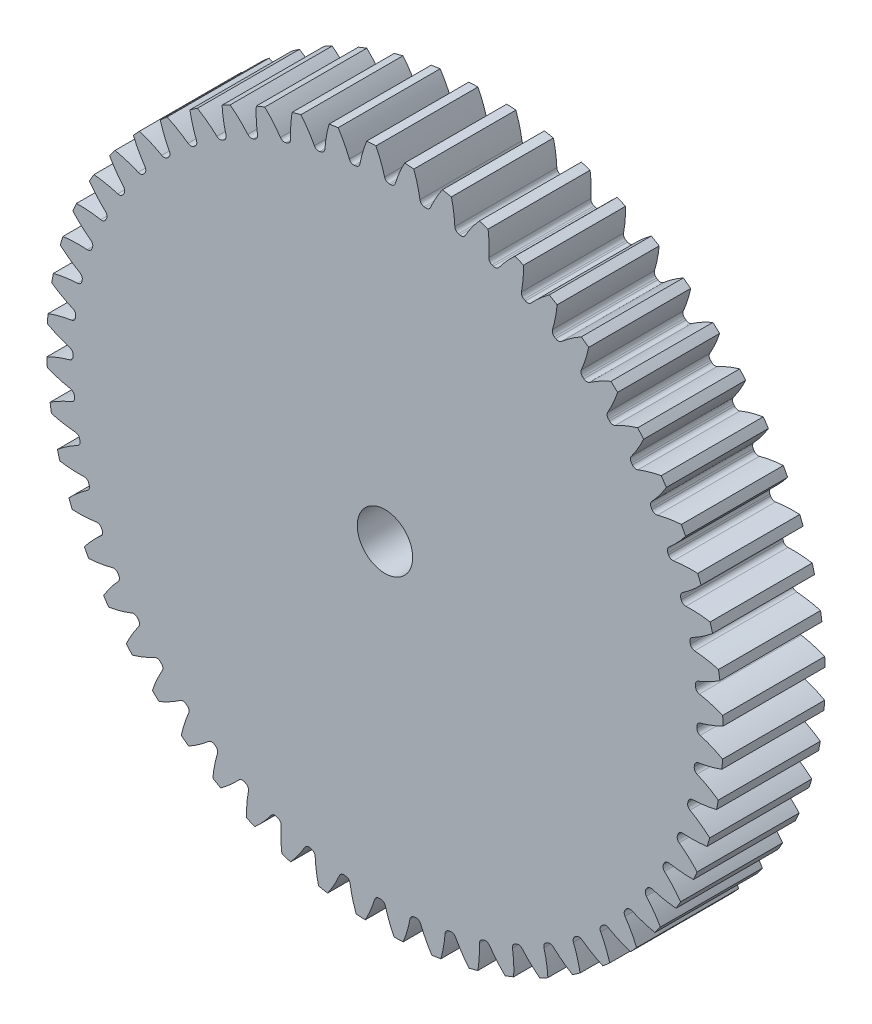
from build123d import *

# Parameters (mm, degrees)
SKETCH3_R         = 294.64
GEARBODY_DEPTH    = 88.9
TOOTHCUT_DEPTH    = 427.061813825
CIRPATTERN1_COUNT = 56
BOREDIA_R         = 24.13
BORE_DEPTH        = 12700


with BuildPart() as part:
    # Sketch3 → gearBody (new body)
    with BuildSketch(Plane.XY):
        Circle(SKETCH3_R)
    extrude(amount=GEARBODY_DEPTH)

    # Sketch2 → toothCut (cut, through all)
    with BuildSketch(Plane.XY):
        with BuildLine():
            ThreePointArc((271.734767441, -4.958282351), (271.746219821, -4.284905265), (271.756003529, -3.611501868))
            ThreePointArc((271.756003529, -3.611501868), (272.62112534, -1.134906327), (274.802183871, 0.322812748))
            ThreePointArc((274.802183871, 0.322812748), (284.913297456, 3.637008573), (294.64, 7.95091278))
            ThreePointArc((294.64, 7.95091278), (294.71062404, -4.64700891), (294.242844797, -17.236441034))
            ThreePointArc((294.242844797, -17.236441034), (284.656987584, -12.618015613), (274.655391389, -8.986681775))
            ThreePointArc((274.655391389, -8.986681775), (272.521376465, -7.460922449), (271.734767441, -4.958282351))
        make_face()
    toothcut = extrude(amount=TOOTHCUT_DEPTH, mode=Mode.SUBTRACT)

    # CirPattern1: toothCut ×56 about axis
    cirpattern1_axis = Axis((0, 0, 0), (0, 0, 1))
    for i in range(1, CIRPATTERN1_COUNT):
        add(toothcut.rotate(cirpattern1_axis, i * 360 / CIRPATTERN1_COUNT), mode=Mode.SUBTRACT)

    # boreDia → bore (cut, symmetric)
    with BuildSketch(Plane.XY):
        Circle(BOREDIA_R)
    extrude(amount=BORE_DEPTH, both=True, mode=Mode.SUBTRACT)


solid = part.part
